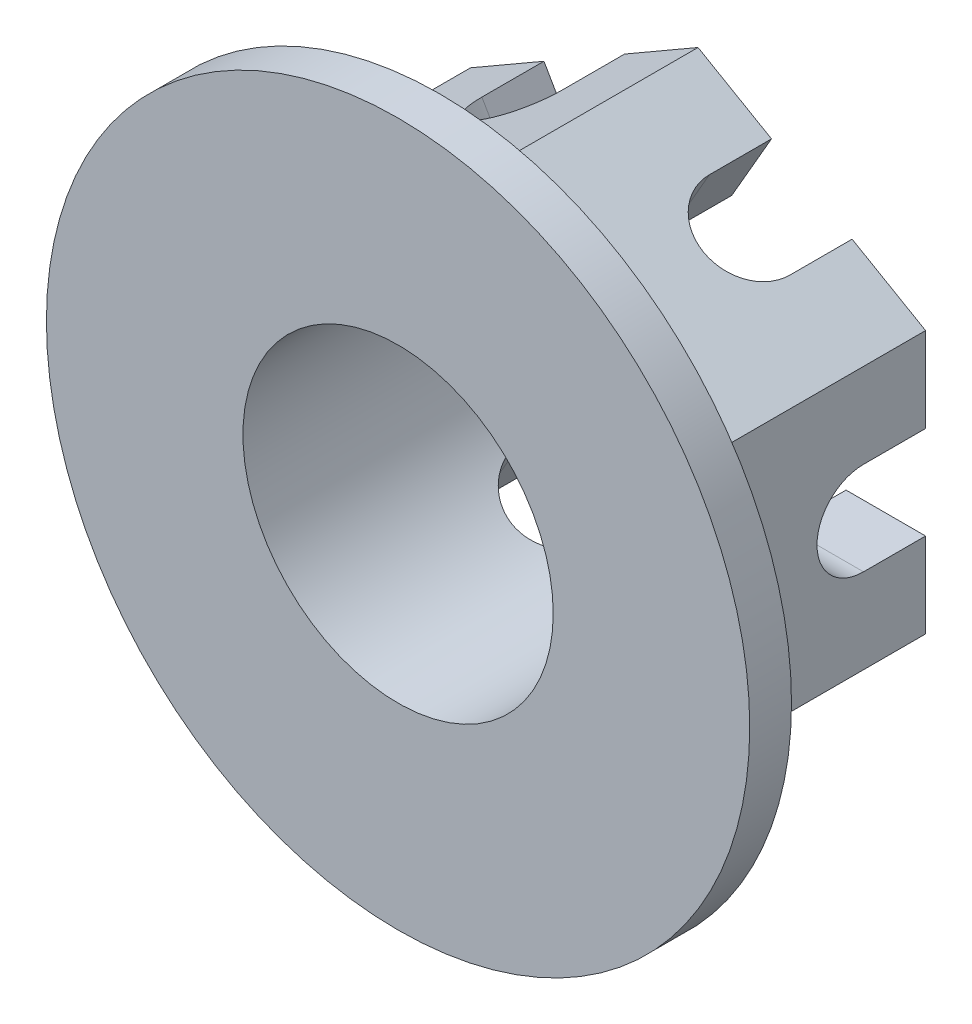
ISO-10303-21;
HEADER;
FILE_DESCRIPTION(('STEP AP214'),'2;1');
FILE_NAME('part.step','',(''),(''),'','','');
FILE_SCHEMA(('AUTOMOTIVE_DESIGN { 1 0 10303 214 1 1 1 1 }'));
ENDSEC;
DATA;
#1=APPLICATION_CONTEXT('core data for automotive mechanical design processes');
#2=APPLICATION_PROTOCOL_DEFINITION('international standard','automotive_design',2000,#1);
#3=PRODUCT_CONTEXT('',#1,'mechanical');
#4=PRODUCT('Part','Part','',(#3));
#5=PRODUCT_RELATED_PRODUCT_CATEGORY('part','',(#4));
#6=PRODUCT_DEFINITION_FORMATION('','',#4);
#7=PRODUCT_DEFINITION_CONTEXT('part definition',#1,'design');
#8=PRODUCT_DEFINITION('design','',#6,#7);
#9=PRODUCT_DEFINITION_SHAPE('','',#8);
#10=(LENGTH_UNIT() NAMED_UNIT(*) SI_UNIT(.MILLI.,.METRE.));
#11=(NAMED_UNIT(*) PLANE_ANGLE_UNIT() SI_UNIT($,.RADIAN.));
#12=(NAMED_UNIT(*) SI_UNIT($,.STERADIAN.) SOLID_ANGLE_UNIT());
#13=UNCERTAINTY_MEASURE_WITH_UNIT(LENGTH_MEASURE(1.E-05),#10,'distance_accuracy_value','');
#14=(GEOMETRIC_REPRESENTATION_CONTEXT(3) GLOBAL_UNCERTAINTY_ASSIGNED_CONTEXT((#13)) GLOBAL_UNIT_ASSIGNED_CONTEXT((#10,
#11,#12)) REPRESENTATION_CONTEXT('',''));
#15=CARTESIAN_POINT('',(0.,0.,0.));
#16=DIRECTION('',(0.,0.,1.));
#17=DIRECTION('',(1.,0.,0.));
#18=AXIS2_PLACEMENT_3D('',#15,#16,#17);
#19=CARTESIAN_POINT('',(11.,19.0525588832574,0.));
#20=DIRECTION('',(0.,0.,1.));
#21=DIRECTION('',(1.,0.,0.));
#22=AXIS2_PLACEMENT_3D('',#19,#20,#21);
#23=PLANE('',#22);
#24=DIRECTION('',(-0.500000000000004,0.866025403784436,0.));
#25=VECTOR('',#24,1.);
#26=CARTESIAN_POINT('',(23.0514428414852,-44.4262701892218,0.));
#27=LINE('',#26,#25);
#28=CARTESIAN_POINT('',(-5.52582916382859,5.07101686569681,0.));
#29=VERTEX_POINT('',#28);
#30=CARTESIAN_POINT('',(-7.44855715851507,8.40127944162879,0.));
#31=VERTEX_POINT('',#30);
#32=EDGE_CURVE('E478',#29,#31,#27,.T.);
#33=ORIENTED_EDGE('',*,*,#32,.F.);
#34=CARTESIAN_POINT('',(0.,0.,0.));
#35=DIRECTION('',(0.,0.,1.));
#36=DIRECTION('',(1.,0.,0.));
#37=AXIS2_PLACEMENT_3D('',#34,#35,#36);
#38=CIRCLE('',#37,7.5);
#39=CARTESIAN_POINT('',(-7.15454401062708,2.25000000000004,0.));
#40=VERTEX_POINT('',#39);
#41=EDGE_CURVE('E606',#29,#40,#38,.T.);
#42=ORIENTED_EDGE('',*,*,#41,.T.);
#43=DIRECTION('',(1.,0.,0.));
#44=VECTOR('',#43,1.);
#45=CARTESIAN_POINT('',(-50.,2.25000000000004,0.));
#46=LINE('',#45,#44);
#47=CARTESIAN_POINT('',(-11.,2.25000000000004,0.));
#48=VERTEX_POINT('',#47);
#49=EDGE_CURVE('E253',#48,#40,#46,.T.);
#50=ORIENTED_EDGE('',*,*,#49,.F.);
#51=DIRECTION('',(0.,-1.,0.));
#52=VECTOR('',#51,1.);
#53=CARTESIAN_POINT('',(-11.,-6.35085296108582,0.));
#54=LINE('',#53,#52);
#55=CARTESIAN_POINT('',(-11.,6.35085296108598,0.));
#56=VERTEX_POINT('',#55);
#57=EDGE_CURVE('E302',#56,#48,#54,.T.);
#58=ORIENTED_EDGE('',*,*,#57,.F.);
#59=DIRECTION('',(-0.866025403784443,-0.499999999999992,0.));
#60=VECTOR('',#59,1.);
#61=CARTESIAN_POINT('',(-11.,6.35085296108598,0.));
#62=LINE('',#61,#60);
#63=EDGE_CURVE('E297',#31,#56,#62,.T.);
#64=ORIENTED_EDGE('',*,*,#63,.F.);
#65=EDGE_LOOP('',(#33,#42,#50,#58,#64));
#66=FACE_BOUND('',#65,.T.);
#67=ADVANCED_FACE('F24',(#66),#23,.F.);
#68=DIRECTION('',(-0.499999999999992,-0.866025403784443,0.));
#69=VECTOR('',#68,1.);
#70=CARTESIAN_POINT('',(23.0514428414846,44.4262701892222,0.));
#71=LINE('',#70,#69);
#72=CARTESIAN_POINT('',(3.55144284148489,10.6512794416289,0.));
#73=VERTEX_POINT('',#72);
#74=CARTESIAN_POINT('',(1.62871484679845,7.32101686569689,0.));
#75=VERTEX_POINT('',#74);
#76=EDGE_CURVE('E371',#73,#75,#71,.T.);
#77=ORIENTED_EDGE('',*,*,#76,.T.);
#78=CARTESIAN_POINT('',(-1.62871484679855,7.32101686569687,0.));
#79=VERTEX_POINT('',#78);
#80=EDGE_CURVE('E236',#75,#79,#38,.T.);
#81=ORIENTED_EDGE('',*,*,#80,.T.);
#82=DIRECTION('',(-0.500000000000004,0.866025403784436,0.));
#83=VECTOR('',#82,1.);
#84=CARTESIAN_POINT('',(26.9485571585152,-42.1762701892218,0.));
#85=LINE('',#84,#83);
#86=CARTESIAN_POINT('',(-3.551442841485,10.6512794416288,0.));
#87=VERTEX_POINT('',#86);
#88=EDGE_CURVE('E373',#79,#87,#85,.T.);
#89=ORIENTED_EDGE('',*,*,#88,.T.);
#90=CARTESIAN_POINT('',(1.31838984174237E-13,12.7017059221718,0.));
#91=VERTEX_POINT('',#90);
#92=EDGE_CURVE('E298',#91,#87,#62,.T.);
#93=ORIENTED_EDGE('',*,*,#92,.F.);
#94=DIRECTION('',(-0.866025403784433,0.50000000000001,0.));
#95=VECTOR('',#94,1.);
#96=CARTESIAN_POINT('',(1.31838984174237E-13,12.7017059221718,0.));
#97=LINE('',#96,#95);
#98=EDGE_CURVE('E293',#73,#91,#97,.T.);
#99=ORIENTED_EDGE('',*,*,#98,.F.);
#100=EDGE_LOOP('',(#77,#81,#89,#93,#99));
#101=FACE_BOUND('',#100,.T.);
#102=ADVANCED_FACE('F369',(#101),#23,.F.);
#103=CARTESIAN_POINT('',(7.44855715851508,-8.40127944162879,0.));
#104=VERTEX_POINT('',#103);
#105=CARTESIAN_POINT('',(5.52582916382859,-5.0710168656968,0.));
#106=VERTEX_POINT('',#105);
#107=EDGE_CURVE('E480',#104,#106,#85,.T.);
#108=ORIENTED_EDGE('',*,*,#107,.T.);
#109=CARTESIAN_POINT('',(7.15454401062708,-2.25000000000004,0.));
#110=VERTEX_POINT('',#109);
#111=EDGE_CURVE('E238',#106,#110,#38,.T.);
#112=ORIENTED_EDGE('',*,*,#111,.T.);
#113=DIRECTION('',(1.,0.,0.));
#114=VECTOR('',#113,1.);
#115=CARTESIAN_POINT('',(-50.,-2.25000000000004,0.));
#116=LINE('',#115,#114);
#117=CARTESIAN_POINT('',(11.,-2.25000000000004,0.));
#118=VERTEX_POINT('',#117);
#119=EDGE_CURVE('E51',#110,#118,#116,.T.);
#120=ORIENTED_EDGE('',*,*,#119,.T.);
#121=DIRECTION('',(0.,1.,0.));
#122=VECTOR('',#121,1.);
#123=CARTESIAN_POINT('',(11.,6.3508529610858,0.));
#124=LINE('',#123,#122);
#125=CARTESIAN_POINT('',(11.,-6.3508529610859,0.));
#126=VERTEX_POINT('',#125);
#127=EDGE_CURVE('E290',#126,#118,#124,.T.);
#128=ORIENTED_EDGE('',*,*,#127,.F.);
#129=DIRECTION('',(0.86602540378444,0.499999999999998,0.));
#130=VECTOR('',#129,1.);
#131=CARTESIAN_POINT('',(11.,-6.3508529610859,0.));
#132=LINE('',#131,#130);
#133=EDGE_CURVE('E309',#104,#126,#132,.T.);
#134=ORIENTED_EDGE('',*,*,#133,.F.);
#135=EDGE_LOOP('',(#108,#112,#120,#128,#134));
#136=FACE_BOUND('',#135,.T.);
#137=ADVANCED_FACE('F417',(#136),#23,.F.);
#138=DIRECTION('',(-0.499999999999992,-0.866025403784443,0.));
#139=VECTOR('',#138,1.);
#140=CARTESIAN_POINT('',(26.9485571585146,42.1762701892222,0.));
#141=LINE('',#140,#139);
#142=CARTESIAN_POINT('',(-1.62871484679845,-7.32101686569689,0.));
#143=VERTEX_POINT('',#142);
#144=CARTESIAN_POINT('',(-3.5514428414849,-10.6512794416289,0.));
#145=VERTEX_POINT('',#144);
#146=EDGE_CURVE('E453',#143,#145,#141,.T.);
#147=ORIENTED_EDGE('',*,*,#146,.F.);
#148=CARTESIAN_POINT('',(1.62871484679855,-7.32101686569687,0.));
#149=VERTEX_POINT('',#148);
#150=EDGE_CURVE('E455',#143,#149,#38,.T.);
#151=ORIENTED_EDGE('',*,*,#150,.T.);
#152=CARTESIAN_POINT('',(3.55144284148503,-10.6512794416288,0.));
#153=VERTEX_POINT('',#152);
#154=EDGE_CURVE('E477',#153,#149,#27,.T.);
#155=ORIENTED_EDGE('',*,*,#154,.F.);
#156=CARTESIAN_POINT('',(0.,-12.7017059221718,0.));
#157=VERTEX_POINT('',#156);
#158=EDGE_CURVE('E310',#157,#153,#132,.T.);
#159=ORIENTED_EDGE('',*,*,#158,.F.);
#160=DIRECTION('',(0.866025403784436,-0.500000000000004,0.));
#161=VECTOR('',#160,1.);
#162=CARTESIAN_POINT('',(0.,-12.7017059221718,0.));
#163=LINE('',#162,#161);
#164=EDGE_CURVE('E305',#145,#157,#163,.T.);
#165=ORIENTED_EDGE('',*,*,#164,.F.);
#166=EDGE_LOOP('',(#147,#151,#155,#159,#165));
#167=FACE_BOUND('',#166,.T.);
#168=ADVANCED_FACE('F431',(#167),#23,.F.);
#169=CARTESIAN_POINT('',(-50.,0.,3.));
#170=DIRECTION('',(1.,0.,0.));
#171=DIRECTION('',(0.,0.,-1.));
#172=AXIS2_PLACEMENT_3D('',#169,#170,#171);
#173=CYLINDRICAL_SURFACE('',#172,2.25);
#174=DIRECTION('',(1.,0.,0.));
#175=VECTOR('',#174,1.);
#176=CARTESIAN_POINT('',(-50.,2.25,3.));
#177=LINE('',#176,#175);
#178=CARTESIAN_POINT('',(-11.,2.25,3.));
#179=VERTEX_POINT('',#178);
#180=CARTESIAN_POINT('',(-7.15454401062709,2.25,3.));
#181=VERTEX_POINT('',#180);
#182=EDGE_CURVE('E260',#179,#181,#177,.T.);
#183=ORIENTED_EDGE('',*,*,#182,.T.);
#184=CARTESIAN_POINT('',(-7.15454401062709,2.25,3.));
#185=CARTESIAN_POINT('',(-7.15453540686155,2.25000770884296,3.06175164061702));
#186=CARTESIAN_POINT('',(-7.15534329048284,2.24745797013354,3.12349834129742));
#187=CARTESIAN_POINT('',(-7.15852809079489,2.2373035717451,3.24652046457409));
#188=CARTESIAN_POINT('',(-7.16090465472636,2.22970004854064,3.30779598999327));
#189=CARTESIAN_POINT('',(-7.16715501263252,2.20952355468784,3.42928868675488));
#190=CARTESIAN_POINT('',(-7.17102500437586,2.19696320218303,3.48950814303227));
#191=CARTESIAN_POINT('',(-7.18013719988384,2.16699639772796,3.60860688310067));
#192=CARTESIAN_POINT('',(-7.18537943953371,2.1495898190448,3.66748613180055));
#193=CARTESIAN_POINT('',(-7.20293728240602,2.09031438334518,3.84146204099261));
#194=CARTESIAN_POINT('',(-7.21709255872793,2.04136389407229,3.95405132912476));
#195=CARTESIAN_POINT('',(-7.24869910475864,1.92611282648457,4.16941953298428));
#196=CARTESIAN_POINT('',(-7.26615190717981,1.8598041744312,4.27219385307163));
#197=CARTESIAN_POINT('',(-7.30300237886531,1.70947409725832,4.46829224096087));
#198=CARTESIAN_POINT('',(-7.32244129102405,1.62500186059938,4.56126365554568));
#199=CARTESIAN_POINT('',(-7.36072221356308,1.44170802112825,4.73195521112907));
#200=CARTESIAN_POINT('',(-7.37956412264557,1.34288399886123,4.80967277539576));
#201=CARTESIAN_POINT('',(-7.41499858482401,1.13116498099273,4.94919514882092));
#202=CARTESIAN_POINT('',(-7.43153656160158,1.01802125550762,5.01063763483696));
#203=CARTESIAN_POINT('',(-7.46001705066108,0.782431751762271,5.1134827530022));
#204=CARTESIAN_POINT('',(-7.47196074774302,0.659988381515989,5.15489055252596));
#205=CARTESIAN_POINT('',(-7.48961459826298,0.412987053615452,5.21531966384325));
#206=CARTESIAN_POINT('',(-7.49549323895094,0.288589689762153,5.23494727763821));
#207=CARTESIAN_POINT('',(-7.5009480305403,0.0381353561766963,5.25317602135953));
#208=CARTESIAN_POINT('',(-7.50052537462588,-0.0879212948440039,5.25178113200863));
#209=CARTESIAN_POINT('',(-7.49354403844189,-0.333857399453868,5.22841063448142));
#210=CARTESIAN_POINT('',(-7.48718123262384,-0.453805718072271,5.20709198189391));
#211=CARTESIAN_POINT('',(-7.46927270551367,-0.688335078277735,5.14555254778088));
#212=CARTESIAN_POINT('',(-7.45772671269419,-0.802915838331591,5.10533077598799));
#213=CARTESIAN_POINT('',(-7.43047822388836,-1.02502172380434,5.00668166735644));
#214=CARTESIAN_POINT('',(-7.41472883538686,-1.13244900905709,4.94804753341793));
#215=CARTESIAN_POINT('',(-7.38074436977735,-1.33614829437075,4.8144021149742));
#216=CARTESIAN_POINT('',(-7.36250873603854,-1.43241778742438,4.73938716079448));
#217=CARTESIAN_POINT('',(-7.32467510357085,-1.61498175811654,4.57171201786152));
#218=CARTESIAN_POINT('',(-7.30505168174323,-1.70075027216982,4.47848420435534));
#219=CARTESIAN_POINT('',(-7.26726322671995,-1.855601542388,4.27875386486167));
#220=CARTESIAN_POINT('',(-7.2490986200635,-1.92467943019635,4.17224747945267));
#221=CARTESIAN_POINT('',(-7.21615843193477,-2.04474610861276,3.9475786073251));
#222=CARTESIAN_POINT('',(-7.20141894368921,-2.09554509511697,3.82930923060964));
#223=CARTESIAN_POINT('',(-7.17743495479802,-2.17628829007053,3.58541324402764));
#224=CARTESIAN_POINT('',(-7.16818205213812,-2.20626439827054,3.45979820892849));
#225=CARTESIAN_POINT('',(-7.15971048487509,-2.23351805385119,3.2775076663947));
#226=CARTESIAN_POINT('',(-7.157777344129,-2.23969804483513,3.22216389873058));
#227=CARTESIAN_POINT('',(-7.15519392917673,-2.24793533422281,3.11122278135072));
#228=CARTESIAN_POINT('',(-7.15454176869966,-2.24999869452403,3.05562592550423));
#229=CARTESIAN_POINT('',(-7.15454401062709,-2.25,3.));
#230=B_SPLINE_CURVE_WITH_KNOTS('',3,(#184,#185,#186,#187,#188,#189,#190,#191,#192,#193,#194,
#195,#196,#197,#198,#199,#200,#201,#202,#203,#204,#205,#206,#207,#208,#209,#210,#211,#212,#213,
#214,#215,#216,#217,#218,#219,#220,#221,#222,#223,#224,#225,#226,#227,#228,#229),.UNSPECIFIED.,
.F.,.F.,(4,2,2,2,2,2,2,2,2,2,2,2,2,2,2,2,2,2,2,2,2,2,4),(0.,0.185188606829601,0.370335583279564,
0.555014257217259,0.739697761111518,1.10860010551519,1.47767434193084,1.85726339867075,
2.23691652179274,2.62442107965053,3.01182563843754,3.38815200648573,3.76440711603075,
4.12867768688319,4.49296734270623,4.86150437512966,5.23012405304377,5.61291926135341,
5.99582598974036,6.3826012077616,6.7687825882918,6.93580700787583,7.10258529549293),.UNSPECIFIED.);
#231=CARTESIAN_POINT('',(-7.15454401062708,-2.25000000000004,3.));
#232=VERTEX_POINT('',#231);
#233=EDGE_CURVE('E571',#181,#232,#230,.T.);
#234=ORIENTED_EDGE('',*,*,#233,.T.);
#235=DIRECTION('',(1.,0.,0.));
#236=VECTOR('',#235,1.);
#237=CARTESIAN_POINT('',(-50.,-2.25,3.));
#238=LINE('',#237,#236);
#239=CARTESIAN_POINT('',(-11.,-2.25,3.));
#240=VERTEX_POINT('',#239);
#241=EDGE_CURVE('E263',#240,#232,#238,.T.);
#242=ORIENTED_EDGE('',*,*,#241,.F.);
#243=CARTESIAN_POINT('',(-11.,0.,3.));
#244=DIRECTION('',(1.,0.,0.));
#245=DIRECTION('',(0.,1.,0.));
#246=AXIS2_PLACEMENT_3D('',#243,#244,#245);
#247=CIRCLE('',#246,2.25);
#248=EDGE_CURVE('E349',#179,#240,#247,.T.);
#249=ORIENTED_EDGE('',*,*,#248,.F.);
#250=EDGE_LOOP('',(#183,#234,#242,#249));
#251=FACE_BOUND('',#250,.T.);
#252=ADVANCED_FACE('F441',(#251),#173,.F.);
#253=CARTESIAN_POINT('',(-50.,2.25,3.));
#254=DIRECTION('',(0.,1.,0.));
#255=DIRECTION('',(0.,0.,1.));
#256=AXIS2_PLACEMENT_3D('',#253,#254,#255);
#257=PLANE('',#256);
#258=ORIENTED_EDGE('',*,*,#49,.T.);
#259=DIRECTION('',(0.,0.,1.));
#260=VECTOR('',#259,1.);
#261=CARTESIAN_POINT('',(-7.15454401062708,2.25000000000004,0.));
#262=LINE('',#261,#260);
#263=EDGE_CURVE('E247',#40,#181,#262,.T.);
#264=ORIENTED_EDGE('',*,*,#263,.T.);
#265=ORIENTED_EDGE('',*,*,#182,.F.);
#266=DIRECTION('',(0.,0.,1.));
#267=VECTOR('',#266,1.);
#268=CARTESIAN_POINT('',(-11.,2.2499999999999,10.0000000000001));
#269=LINE('',#268,#267);
#270=EDGE_CURVE('E273',#48,#179,#269,.T.);
#271=ORIENTED_EDGE('',*,*,#270,.F.);
#272=EDGE_LOOP('',(#258,#264,#265,#271));
#273=FACE_BOUND('',#272,.T.);
#274=ADVANCED_FACE('F436',(#273),#257,.F.);
#275=CARTESIAN_POINT('',(-50.,-2.25,3.));
#276=DIRECTION('',(0.,-1.,0.));
#277=DIRECTION('',(0.,0.,-1.));
#278=AXIS2_PLACEMENT_3D('',#275,#276,#277);
#279=PLANE('',#278);
#280=ORIENTED_EDGE('',*,*,#119,.F.);
#281=DIRECTION('',(0.,0.,1.));
#282=VECTOR('',#281,1.);
#283=CARTESIAN_POINT('',(7.15454401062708,-2.25000000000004,0.));
#284=LINE('',#283,#282);
#285=CARTESIAN_POINT('',(7.15454401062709,-2.25,3.));
#286=VERTEX_POINT('',#285);
#287=EDGE_CURVE('E513',#110,#286,#284,.T.);
#288=ORIENTED_EDGE('',*,*,#287,.T.);
#289=CARTESIAN_POINT('',(11.,-2.25,3.));
#290=VERTEX_POINT('',#289);
#291=EDGE_CURVE('E266',#286,#290,#238,.T.);
#292=ORIENTED_EDGE('',*,*,#291,.T.);
#293=DIRECTION('',(0.,0.,1.));
#294=VECTOR('',#293,1.);
#295=CARTESIAN_POINT('',(11.,-2.2499999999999,10.0000000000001));
#296=LINE('',#295,#294);
#297=EDGE_CURVE('E270',#118,#290,#296,.T.);
#298=ORIENTED_EDGE('',*,*,#297,.F.);
#299=EDGE_LOOP('',(#280,#288,#292,#298));
#300=FACE_BOUND('',#299,.T.);
#301=ADVANCED_FACE('F430',(#300),#279,.F.);
#302=CARTESIAN_POINT('',(7.15454401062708,2.25000000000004,0.));
#303=VERTEX_POINT('',#302);
#304=CARTESIAN_POINT('',(11.,2.25000000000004,0.));
#305=VERTEX_POINT('',#304);
#306=EDGE_CURVE('E243',#303,#305,#46,.T.);
#307=ORIENTED_EDGE('',*,*,#306,.F.);
#308=CARTESIAN_POINT('',(5.52582916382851,5.07101686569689,0.));
#309=VERTEX_POINT('',#308);
#310=EDGE_CURVE('E225',#303,#309,#38,.T.);
#311=ORIENTED_EDGE('',*,*,#310,.T.);
#312=CARTESIAN_POINT('',(7.44855715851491,8.40127944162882,0.));
#313=VERTEX_POINT('',#312);
#314=EDGE_CURVE('E462',#313,#309,#141,.T.);
#315=ORIENTED_EDGE('',*,*,#314,.F.);
#316=CARTESIAN_POINT('',(11.,6.3508529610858,0.));
#317=VERTEX_POINT('',#316);
#318=EDGE_CURVE('E294',#317,#313,#97,.T.);
#319=ORIENTED_EDGE('',*,*,#318,.F.);
#320=EDGE_CURVE('E252',#305,#317,#124,.T.);
#321=ORIENTED_EDGE('',*,*,#320,.F.);
#322=EDGE_LOOP('',(#307,#311,#315,#319,#321));
#323=FACE_BOUND('',#322,.T.);
#324=ADVANCED_FACE('F250',(#323),#23,.F.);
#325=CARTESIAN_POINT('',(0.,0.,10.));
#326=DIRECTION('',(0.,0.,1.));
#327=DIRECTION('',(1.,0.,0.));
#328=AXIS2_PLACEMENT_3D('',#325,#326,#327);
#329=CONICAL_SURFACE('',#328,12.7017059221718,1.0471975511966);
#330=CARTESIAN_POINT('',(0.,0.,10.));
#331=DIRECTION('',(0.,0.,1.));
#332=DIRECTION('',(1.,0.,0.));
#333=AXIS2_PLACEMENT_3D('',#330,#331,#332);
#334=CIRCLE('',#333,12.7017059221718);
#335=CARTESIAN_POINT('',(11.,6.3508529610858,10.));
#336=VERTEX_POINT('',#335);
#337=CARTESIAN_POINT('',(1.31838984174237E-13,12.7017059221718,10.));
#338=VERTEX_POINT('',#337);
#339=EDGE_CURVE('E286',#336,#338,#334,.T.);
#340=ORIENTED_EDGE('',*,*,#339,.T.);
#341=CARTESIAN_POINT('',(-11.,6.35085296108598,10.));
#342=VERTEX_POINT('',#341);
#343=EDGE_CURVE('E289',#338,#342,#334,.T.);
#344=ORIENTED_EDGE('',*,*,#343,.T.);
#345=CARTESIAN_POINT('',(-11.,-6.35085296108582,10.));
#346=VERTEX_POINT('',#345);
#347=EDGE_CURVE('E660',#342,#346,#334,.T.);
#348=ORIENTED_EDGE('',*,*,#347,.T.);
#349=CARTESIAN_POINT('',(0.,-12.7017059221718,10.));
#350=VERTEX_POINT('',#349);
#351=EDGE_CURVE('E661',#346,#350,#334,.T.);
#352=ORIENTED_EDGE('',*,*,#351,.T.);
#353=CARTESIAN_POINT('',(11.,-6.35085296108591,10.));
#354=VERTEX_POINT('',#353);
#355=EDGE_CURVE('E396',#350,#354,#334,.T.);
#356=ORIENTED_EDGE('',*,*,#355,.T.);
#357=EDGE_CURVE('E285',#354,#336,#334,.T.);
#358=ORIENTED_EDGE('',*,*,#357,.T.);
#359=EDGE_LOOP('',(#340,#344,#348,#352,#356,#358));
#360=FACE_BOUND('',#359,.T.);
#361=CARTESIAN_POINT('',(0.,0.,12.4816212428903));
#362=DIRECTION('',(0.,0.,1.));
#363=DIRECTION('',(1.,0.,0.));
#364=AXIS2_PLACEMENT_3D('',#361,#362,#363);
#365=CIRCLE('',#364,17.);
#366=CARTESIAN_POINT('',(17.,0.,12.4816212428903));
#367=VERTEX_POINT('',#366);
#368=EDGE_CURVE('E282',#367,#367,#365,.T.);
#369=ORIENTED_EDGE('',*,*,#368,.F.);
#370=EDGE_LOOP('',(#369));
#371=FACE_BOUND('',#370,.T.);
#372=ADVANCED_FACE('F391',(#360,#371),#329,.T.);
#373=CARTESIAN_POINT('',(11.,6.3508529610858,10.));
#374=DIRECTION('',(-1.,0.,0.));
#375=DIRECTION('',(0.,-1.,0.));
#376=AXIS2_PLACEMENT_3D('',#373,#374,#375);
#377=PLANE('',#376);
#378=CARTESIAN_POINT('',(11.,0.,3.));
#379=DIRECTION('',(-1.,0.,0.));
#380=DIRECTION('',(0.,-1.,0.));
#381=AXIS2_PLACEMENT_3D('',#378,#379,#380);
#382=CIRCLE('',#381,2.25);
#383=CARTESIAN_POINT('',(11.,2.25,3.));
#384=VERTEX_POINT('',#383);
#385=EDGE_CURVE('E278',#290,#384,#382,.T.);
#386=ORIENTED_EDGE('',*,*,#385,.T.);
#387=DIRECTION('',(0.,0.,-1.));
#388=VECTOR('',#387,1.);
#389=CARTESIAN_POINT('',(11.,2.2499999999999,9.99999999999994));
#390=LINE('',#389,#388);
#391=EDGE_CURVE('E276',#384,#305,#390,.T.);
#392=ORIENTED_EDGE('',*,*,#391,.T.);
#393=ORIENTED_EDGE('',*,*,#320,.T.);
#394=DIRECTION('',(0.,0.,-1.));
#395=VECTOR('',#394,1.);
#396=CARTESIAN_POINT('',(11.,6.3508529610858,10.));
#397=LINE('',#396,#395);
#398=EDGE_CURVE('E346',#336,#317,#397,.T.);
#399=ORIENTED_EDGE('',*,*,#398,.F.);
#400=DIRECTION('',(0.,1.,0.));
#401=VECTOR('',#400,1.);
#402=CARTESIAN_POINT('',(11.,6.3508529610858,10.));
#403=LINE('',#402,#401);
#404=EDGE_CURVE('E313',#354,#336,#403,.T.);
#405=ORIENTED_EDGE('',*,*,#404,.F.);
#406=DIRECTION('',(0.,0.,-1.));
#407=VECTOR('',#406,1.);
#408=CARTESIAN_POINT('',(11.,-6.3508529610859,10.));
#409=LINE('',#408,#407);
#410=EDGE_CURVE('E331',#354,#126,#409,.T.);
#411=ORIENTED_EDGE('',*,*,#410,.T.);
#412=ORIENTED_EDGE('',*,*,#127,.T.);
#413=ORIENTED_EDGE('',*,*,#297,.T.);
#414=EDGE_LOOP('',(#386,#392,#393,#399,#405,#411,#412,#413));
#415=FACE_BOUND('',#414,.T.);
#416=ADVANCED_FACE('F26',(#415),#377,.F.);
#417=CARTESIAN_POINT('',(1.31838984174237E-13,12.7017059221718,10.));
#418=DIRECTION('',(-0.50000000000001,-0.866025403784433,0.));
#419=DIRECTION('',(0.866025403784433,-0.50000000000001,0.));
#420=AXIS2_PLACEMENT_3D('',#417,#418,#419);
#421=PLANE('',#420);
#422=CARTESIAN_POINT('',(5.49999999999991,9.52627944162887,3.));
#423=DIRECTION('',(-0.50000000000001,-0.866025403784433,0.));
#424=DIRECTION('',(0.866025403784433,-0.50000000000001,0.));
#425=AXIS2_PLACEMENT_3D('',#422,#423,#424);
#426=CIRCLE('',#425,2.25);
#427=CARTESIAN_POINT('',(7.44855715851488,8.40127944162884,3.));
#428=VERTEX_POINT('',#427);
#429=CARTESIAN_POINT('',(3.55144284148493,10.6512794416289,3.));
#430=VERTEX_POINT('',#429);
#431=EDGE_CURVE('E362',#428,#430,#426,.T.);
#432=ORIENTED_EDGE('',*,*,#431,.T.);
#433=DIRECTION('',(0.,0.,-1.));
#434=VECTOR('',#433,1.);
#435=CARTESIAN_POINT('',(3.55144284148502,10.6512794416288,9.99999999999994));
#436=LINE('',#435,#434);
#437=EDGE_CURVE('E37',#430,#73,#436,.T.);
#438=ORIENTED_EDGE('',*,*,#437,.T.);
#439=ORIENTED_EDGE('',*,*,#98,.T.);
#440=DIRECTION('',(0.,0.,-1.));
#441=VECTOR('',#440,1.);
#442=CARTESIAN_POINT('',(1.31838984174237E-13,12.7017059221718,10.));
#443=LINE('',#442,#441);
#444=EDGE_CURVE('E343',#338,#91,#443,.T.);
#445=ORIENTED_EDGE('',*,*,#444,.F.);
#446=DIRECTION('',(-0.866025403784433,0.50000000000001,0.));
#447=VECTOR('',#446,1.);
#448=CARTESIAN_POINT('',(1.31838984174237E-13,12.7017059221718,10.));
#449=LINE('',#448,#447);
#450=EDGE_CURVE('E316',#336,#338,#449,.T.);
#451=ORIENTED_EDGE('',*,*,#450,.F.);
#452=ORIENTED_EDGE('',*,*,#398,.T.);
#453=ORIENTED_EDGE('',*,*,#318,.T.);
#454=DIRECTION('',(0.,0.,1.));
#455=VECTOR('',#454,1.);
#456=CARTESIAN_POINT('',(7.4485571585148,8.4012794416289,10.0000000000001));
#457=LINE('',#456,#455);
#458=EDGE_CURVE('E500',#313,#428,#457,.T.);
#459=ORIENTED_EDGE('',*,*,#458,.T.);
#460=EDGE_LOOP('',(#432,#438,#439,#445,#451,#452,#453,#459));
#461=FACE_BOUND('',#460,.T.);
#462=ADVANCED_FACE('F360',(#461),#421,.F.);
#463=CARTESIAN_POINT('',(-11.,6.35085296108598,10.));
#464=DIRECTION('',(0.499999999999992,-0.866025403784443,0.));
#465=DIRECTION('',(0.866025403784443,0.499999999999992,0.));
#466=AXIS2_PLACEMENT_3D('',#463,#464,#465);
#467=PLANE('',#466);
#468=CARTESIAN_POINT('',(-5.50000000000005,9.52627944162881,3.));
#469=DIRECTION('',(0.499999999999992,-0.866025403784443,0.));
#470=DIRECTION('',(0.866025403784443,0.499999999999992,0.));
#471=AXIS2_PLACEMENT_3D('',#468,#469,#470);
#472=CIRCLE('',#471,2.25);
#473=CARTESIAN_POINT('',(-3.55144284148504,10.6512794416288,3.));
#474=VERTEX_POINT('',#473);
#475=CARTESIAN_POINT('',(-7.44855715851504,8.40127944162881,3.));
#476=VERTEX_POINT('',#475);
#477=EDGE_CURVE('E505',#474,#476,#472,.T.);
#478=ORIENTED_EDGE('',*,*,#477,.T.);
#479=DIRECTION('',(0.,0.,-1.));
#480=VECTOR('',#479,1.);
#481=CARTESIAN_POINT('',(-7.44855715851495,8.40127944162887,9.99999999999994));
#482=LINE('',#481,#480);
#483=EDGE_CURVE('E502',#476,#31,#482,.T.);
#484=ORIENTED_EDGE('',*,*,#483,.T.);
#485=ORIENTED_EDGE('',*,*,#63,.T.);
#486=DIRECTION('',(0.,0.,-1.));
#487=VECTOR('',#486,1.);
#488=CARTESIAN_POINT('',(-11.,6.35085296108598,10.));
#489=LINE('',#488,#487);
#490=EDGE_CURVE('E340',#342,#56,#489,.T.);
#491=ORIENTED_EDGE('',*,*,#490,.F.);
#492=DIRECTION('',(-0.866025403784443,-0.499999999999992,0.));
#493=VECTOR('',#492,1.);
#494=CARTESIAN_POINT('',(-11.,6.35085296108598,10.));
#495=LINE('',#494,#493);
#496=EDGE_CURVE('E319',#338,#342,#495,.T.);
#497=ORIENTED_EDGE('',*,*,#496,.F.);
#498=ORIENTED_EDGE('',*,*,#444,.T.);
#499=ORIENTED_EDGE('',*,*,#92,.T.);
#500=DIRECTION('',(0.,0.,1.));
#501=VECTOR('',#500,1.);
#502=CARTESIAN_POINT('',(-3.55144284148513,10.6512794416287,10.0000000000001));
#503=LINE('',#502,#501);
#504=EDGE_CURVE('E354',#87,#474,#503,.T.);
#505=ORIENTED_EDGE('',*,*,#504,.T.);
#506=EDGE_LOOP('',(#478,#484,#485,#491,#497,#498,#499,#505));
#507=FACE_BOUND('',#506,.T.);
#508=ADVANCED_FACE('F377',(#507),#467,.F.);
#509=CARTESIAN_POINT('',(-11.,-6.35085296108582,10.));
#510=DIRECTION('',(1.,0.,0.));
#511=DIRECTION('',(0.,1.,0.));
#512=AXIS2_PLACEMENT_3D('',#509,#510,#511);
#513=PLANE('',#512);
#514=ORIENTED_EDGE('',*,*,#57,.T.);
#515=ORIENTED_EDGE('',*,*,#270,.T.);
#516=ORIENTED_EDGE('',*,*,#248,.T.);
#517=DIRECTION('',(0.,0.,-1.));
#518=VECTOR('',#517,1.);
#519=CARTESIAN_POINT('',(-11.,-2.2499999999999,9.99999999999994));
#520=LINE('',#519,#518);
#521=CARTESIAN_POINT('',(-11.,-2.25000000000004,0.));
#522=VERTEX_POINT('',#521);
#523=EDGE_CURVE('E267',#240,#522,#520,.T.);
#524=ORIENTED_EDGE('',*,*,#523,.T.);
#525=CARTESIAN_POINT('',(-11.,-6.35085296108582,0.));
#526=VERTEX_POINT('',#525);
#527=EDGE_CURVE('E301',#522,#526,#54,.T.);
#528=ORIENTED_EDGE('',*,*,#527,.T.);
#529=DIRECTION('',(0.,0.,-1.));
#530=VECTOR('',#529,1.);
#531=CARTESIAN_POINT('',(-11.,-6.35085296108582,10.));
#532=LINE('',#531,#530);
#533=EDGE_CURVE('E337',#346,#526,#532,.T.);
#534=ORIENTED_EDGE('',*,*,#533,.F.);
#535=DIRECTION('',(0.,-1.,0.));
#536=VECTOR('',#535,1.);
#537=CARTESIAN_POINT('',(-11.,-6.35085296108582,10.));
#538=LINE('',#537,#536);
#539=EDGE_CURVE('E322',#342,#346,#538,.T.);
#540=ORIENTED_EDGE('',*,*,#539,.F.);
#541=ORIENTED_EDGE('',*,*,#490,.T.);
#542=EDGE_LOOP('',(#514,#515,#516,#524,#528,#534,#540,#541));
#543=FACE_BOUND('',#542,.T.);
#544=ADVANCED_FACE('F651',(#543),#513,.F.);
#545=CARTESIAN_POINT('',(0.,-12.7017059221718,10.));
#546=DIRECTION('',(0.500000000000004,0.866025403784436,0.));
#547=DIRECTION('',(-0.866025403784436,0.500000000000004,0.));
#548=AXIS2_PLACEMENT_3D('',#545,#546,#547);
#549=PLANE('',#548);
#550=CARTESIAN_POINT('',(-5.49999999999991,-9.52627944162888,3.));
#551=DIRECTION('',(0.500000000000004,0.866025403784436,0.));
#552=DIRECTION('',(-0.866025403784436,0.500000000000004,0.));
#553=AXIS2_PLACEMENT_3D('',#550,#551,#552);
#554=CIRCLE('',#553,2.25);
#555=CARTESIAN_POINT('',(-7.4485571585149,-8.40127944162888,3.));
#556=VERTEX_POINT('',#555);
#557=CARTESIAN_POINT('',(-3.55144284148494,-10.6512794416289,3.));
#558=VERTEX_POINT('',#557);
#559=EDGE_CURVE('E490',#556,#558,#554,.T.);
#560=ORIENTED_EDGE('',*,*,#559,.T.);
#561=DIRECTION('',(0.,0.,-1.));
#562=VECTOR('',#561,1.);
#563=CARTESIAN_POINT('',(-3.55144284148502,-10.6512794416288,9.99999999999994));
#564=LINE('',#563,#562);
#565=EDGE_CURVE('E507',#558,#145,#564,.T.);
#566=ORIENTED_EDGE('',*,*,#565,.T.);
#567=ORIENTED_EDGE('',*,*,#164,.T.);
#568=DIRECTION('',(0.,0.,-1.));
#569=VECTOR('',#568,1.);
#570=CARTESIAN_POINT('',(0.,-12.7017059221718,10.));
#571=LINE('',#570,#569);
#572=EDGE_CURVE('E334',#350,#157,#571,.T.);
#573=ORIENTED_EDGE('',*,*,#572,.F.);
#574=DIRECTION('',(0.866025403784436,-0.500000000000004,0.));
#575=VECTOR('',#574,1.);
#576=CARTESIAN_POINT('',(0.,-12.7017059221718,10.));
#577=LINE('',#576,#575);
#578=EDGE_CURVE('E325',#346,#350,#577,.T.);
#579=ORIENTED_EDGE('',*,*,#578,.F.);
#580=ORIENTED_EDGE('',*,*,#533,.T.);
#581=CARTESIAN_POINT('',(-7.44855715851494,-8.40127944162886,0.));
#582=VERTEX_POINT('',#581);
#583=EDGE_CURVE('E306',#526,#582,#163,.T.);
#584=ORIENTED_EDGE('',*,*,#583,.T.);
#585=DIRECTION('',(0.,0.,1.));
#586=VECTOR('',#585,1.);
#587=CARTESIAN_POINT('',(-7.4485571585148,-8.40127944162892,10.0000000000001));
#588=LINE('',#587,#586);
#589=EDGE_CURVE('E487',#582,#556,#588,.T.);
#590=ORIENTED_EDGE('',*,*,#589,.T.);
#591=EDGE_LOOP('',(#560,#566,#567,#573,#579,#580,#584,#590));
#592=FACE_BOUND('',#591,.T.);
#593=ADVANCED_FACE('F427',(#592),#549,.F.);
#594=CARTESIAN_POINT('',(11.,-6.3508529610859,10.));
#595=DIRECTION('',(-0.499999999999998,0.86602540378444,0.));
#596=DIRECTION('',(-0.86602540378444,-0.499999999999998,0.));
#597=AXIS2_PLACEMENT_3D('',#594,#595,#596);
#598=PLANE('',#597);
#599=ORIENTED_EDGE('',*,*,#158,.T.);
#600=DIRECTION('',(0.,0.,1.));
#601=VECTOR('',#600,1.);
#602=CARTESIAN_POINT('',(3.55144284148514,-10.6512794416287,10.0000000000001));
#603=LINE('',#602,#601);
#604=CARTESIAN_POINT('',(3.55144284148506,-10.6512794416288,3.));
#605=VERTEX_POINT('',#604);
#606=EDGE_CURVE('E508',#153,#605,#603,.T.);
#607=ORIENTED_EDGE('',*,*,#606,.T.);
#608=CARTESIAN_POINT('',(5.50000000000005,-9.52627944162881,3.));
#609=DIRECTION('',(-0.499999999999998,0.86602540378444,0.));
#610=DIRECTION('',(-0.86602540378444,-0.499999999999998,0.));
#611=AXIS2_PLACEMENT_3D('',#608,#609,#610);
#612=CIRCLE('',#611,2.25);
#613=CARTESIAN_POINT('',(7.44855715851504,-8.40127944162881,3.));
#614=VERTEX_POINT('',#613);
#615=EDGE_CURVE('E493',#605,#614,#612,.T.);
#616=ORIENTED_EDGE('',*,*,#615,.T.);
#617=DIRECTION('',(0.,0.,-1.));
#618=VECTOR('',#617,1.);
#619=CARTESIAN_POINT('',(7.44855715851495,-8.40127944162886,9.99999999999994));
#620=LINE('',#619,#618);
#621=EDGE_CURVE('E496',#614,#104,#620,.T.);
#622=ORIENTED_EDGE('',*,*,#621,.T.);
#623=ORIENTED_EDGE('',*,*,#133,.T.);
#624=ORIENTED_EDGE('',*,*,#410,.F.);
#625=DIRECTION('',(0.86602540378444,0.499999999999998,0.));
#626=VECTOR('',#625,1.);
#627=CARTESIAN_POINT('',(11.,-6.3508529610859,10.));
#628=LINE('',#627,#626);
#629=EDGE_CURVE('E328',#350,#354,#628,.T.);
#630=ORIENTED_EDGE('',*,*,#629,.F.);
#631=ORIENTED_EDGE('',*,*,#572,.T.);
#632=EDGE_LOOP('',(#599,#607,#616,#622,#623,#624,#630,#631));
#633=FACE_BOUND('',#632,.T.);
#634=ADVANCED_FACE('F422',(#633),#598,.F.);
#635=CARTESIAN_POINT('',(-7.15454401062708,-2.25000000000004,0.));
#636=VERTEX_POINT('',#635);
#637=EDGE_CURVE('E254',#522,#636,#116,.T.);
#638=ORIENTED_EDGE('',*,*,#637,.T.);
#639=CARTESIAN_POINT('',(-5.52582916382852,-5.07101686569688,0.));
#640=VERTEX_POINT('',#639);
#641=EDGE_CURVE('E604',#636,#640,#38,.T.);
#642=ORIENTED_EDGE('',*,*,#641,.T.);
#643=EDGE_CURVE('E465',#640,#582,#71,.T.);
#644=ORIENTED_EDGE('',*,*,#643,.T.);
#645=ORIENTED_EDGE('',*,*,#583,.F.);
#646=ORIENTED_EDGE('',*,*,#527,.F.);
#647=EDGE_LOOP('',(#638,#642,#644,#645,#646));
#648=FACE_BOUND('',#647,.T.);
#649=ADVANCED_FACE('F407',(#648),#23,.F.);
#650=CARTESIAN_POINT('',(0.,0.,10.));
#651=DIRECTION('',(0.,0.,1.));
#652=DIRECTION('',(1.,0.,0.));
#653=AXIS2_PLACEMENT_3D('',#650,#651,#652);
#654=PLANE('',#653);
#655=ORIENTED_EDGE('',*,*,#357,.F.);
#656=ORIENTED_EDGE('',*,*,#404,.T.);
#657=EDGE_LOOP('',(#655,#656));
#658=FACE_BOUND('',#657,.T.);
#659=ADVANCED_FACE('F388',(#658),#654,.F.);
#660=ORIENTED_EDGE('',*,*,#339,.F.);
#661=ORIENTED_EDGE('',*,*,#450,.T.);
#662=EDGE_LOOP('',(#660,#661));
#663=FACE_BOUND('',#662,.T.);
#664=ADVANCED_FACE('F397',(#663),#654,.F.);
#665=ORIENTED_EDGE('',*,*,#343,.F.);
#666=ORIENTED_EDGE('',*,*,#496,.T.);
#667=EDGE_LOOP('',(#665,#666));
#668=FACE_BOUND('',#667,.T.);
#669=ADVANCED_FACE('F399',(#668),#654,.F.);
#670=ORIENTED_EDGE('',*,*,#347,.F.);
#671=ORIENTED_EDGE('',*,*,#539,.T.);
#672=EDGE_LOOP('',(#670,#671));
#673=FACE_BOUND('',#672,.T.);
#674=ADVANCED_FACE('F405',(#673),#654,.F.);
#675=ORIENTED_EDGE('',*,*,#351,.F.);
#676=ORIENTED_EDGE('',*,*,#578,.T.);
#677=EDGE_LOOP('',(#675,#676));
#678=FACE_BOUND('',#677,.T.);
#679=ADVANCED_FACE('F663',(#678),#654,.F.);
#680=ORIENTED_EDGE('',*,*,#355,.F.);
#681=ORIENTED_EDGE('',*,*,#629,.T.);
#682=EDGE_LOOP('',(#680,#681));
#683=FACE_BOUND('',#682,.T.);
#684=ADVANCED_FACE('F408',(#683),#654,.F.);
#685=CARTESIAN_POINT('',(0.,0.,43.8636128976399));
#686=DIRECTION('',(0.,0.,1.));
#687=DIRECTION('',(1.,0.,0.));
#688=AXIS2_PLACEMENT_3D('',#685,#686,#687);
#689=CYLINDRICAL_SURFACE('',#688,17.);
#690=CARTESIAN_POINT('',(0.,0.,14.5));
#691=DIRECTION('',(0.,0.,1.));
#692=DIRECTION('',(1.,0.,0.));
#693=AXIS2_PLACEMENT_3D('',#690,#691,#692);
#694=CIRCLE('',#693,17.);
#695=CARTESIAN_POINT('',(17.,0.,14.5));
#696=VERTEX_POINT('',#695);
#697=EDGE_CURVE('E281',#696,#696,#694,.T.);
#698=ORIENTED_EDGE('',*,*,#697,.F.);
#699=EDGE_LOOP('',(#698));
#700=FACE_BOUND('',#699,.T.);
#701=ORIENTED_EDGE('',*,*,#368,.T.);
#702=EDGE_LOOP('',(#701));
#703=FACE_BOUND('',#702,.T.);
#704=ADVANCED_FACE('F582',(#700,#703),#689,.T.);
#705=CARTESIAN_POINT('',(0.,0.,14.5));
#706=DIRECTION('',(0.,0.,1.));
#707=DIRECTION('',(1.,0.,0.));
#708=AXIS2_PLACEMENT_3D('',#705,#706,#707);
#709=PLANE('',#708);
#710=CARTESIAN_POINT('',(0.,0.,14.5));
#711=DIRECTION('',(0.,0.,1.));
#712=DIRECTION('',(1.,0.,0.));
#713=AXIS2_PLACEMENT_3D('',#710,#711,#712);
#714=CIRCLE('',#713,7.5);
#715=CARTESIAN_POINT('',(7.5,0.,14.5));
#716=VERTEX_POINT('',#715);
#717=EDGE_CURVE('E610',#716,#716,#714,.T.);
#718=ORIENTED_EDGE('',*,*,#717,.F.);
#719=EDGE_LOOP('',(#718));
#720=FACE_BOUND('',#719,.T.);
#721=ORIENTED_EDGE('',*,*,#697,.T.);
#722=EDGE_LOOP('',(#721));
#723=FACE_BOUND('',#722,.T.);
#724=ADVANCED_FACE('F581',(#720,#723),#709,.T.);
#725=ORIENTED_EDGE('',*,*,#291,.F.);
#726=CARTESIAN_POINT('',(7.15454401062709,-2.25,3.));
#727=CARTESIAN_POINT('',(7.15453540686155,-2.25000770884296,3.06175164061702));
#728=CARTESIAN_POINT('',(7.15534329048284,-2.24745797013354,3.12349834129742));
#729=CARTESIAN_POINT('',(7.15852809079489,-2.2373035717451,3.24652046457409));
#730=CARTESIAN_POINT('',(7.16090465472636,-2.22970004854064,3.30779598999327));
#731=CARTESIAN_POINT('',(7.16715501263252,-2.20952355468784,3.42928868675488));
#732=CARTESIAN_POINT('',(7.17102500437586,-2.19696320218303,3.48950814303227));
#733=CARTESIAN_POINT('',(7.18013719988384,-2.16699639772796,3.60860688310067));
#734=CARTESIAN_POINT('',(7.18537943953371,-2.1495898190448,3.66748613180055));
#735=CARTESIAN_POINT('',(7.20293728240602,-2.09031438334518,3.84146204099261));
#736=CARTESIAN_POINT('',(7.21709255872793,-2.04136389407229,3.95405132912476));
#737=CARTESIAN_POINT('',(7.24869910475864,-1.92611282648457,4.16941953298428));
#738=CARTESIAN_POINT('',(7.2661519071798,-1.8598041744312,4.27219385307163));
#739=CARTESIAN_POINT('',(7.30300237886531,-1.70947409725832,4.46829224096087));
#740=CARTESIAN_POINT('',(7.32244129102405,-1.62500186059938,4.56126365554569));
#741=CARTESIAN_POINT('',(7.36072221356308,-1.44170802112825,4.73195521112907));
#742=CARTESIAN_POINT('',(7.37956412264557,-1.34288399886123,4.80967277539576));
#743=CARTESIAN_POINT('',(7.41499858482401,-1.13116498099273,4.94919514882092));
#744=CARTESIAN_POINT('',(7.43153656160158,-1.01802125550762,5.01063763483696));
#745=CARTESIAN_POINT('',(7.46001705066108,-0.78243175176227,5.1134827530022));
#746=CARTESIAN_POINT('',(7.47196074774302,-0.659988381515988,5.15489055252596));
#747=CARTESIAN_POINT('',(7.48961459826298,-0.412987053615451,5.21531966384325));
#748=CARTESIAN_POINT('',(7.49549323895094,-0.288589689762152,5.23494727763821));
#749=CARTESIAN_POINT('',(7.5009480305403,-0.0381353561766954,5.25317602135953));
#750=CARTESIAN_POINT('',(7.50052537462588,0.0879212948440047,5.25178113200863));
#751=CARTESIAN_POINT('',(7.49354403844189,0.333857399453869,5.22841063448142));
#752=CARTESIAN_POINT('',(7.48718123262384,0.453805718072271,5.20709198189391));
#753=CARTESIAN_POINT('',(7.46927270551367,0.688335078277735,5.14555254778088));
#754=CARTESIAN_POINT('',(7.45772671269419,0.802915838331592,5.10533077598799));
#755=CARTESIAN_POINT('',(7.43047822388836,1.02502172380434,5.00668166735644));
#756=CARTESIAN_POINT('',(7.41472883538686,1.13244900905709,4.94804753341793));
#757=CARTESIAN_POINT('',(7.38074436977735,1.33614829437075,4.8144021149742));
#758=CARTESIAN_POINT('',(7.36250873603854,1.43241778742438,4.73938716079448));
#759=CARTESIAN_POINT('',(7.32467510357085,1.61498175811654,4.57171201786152));
#760=CARTESIAN_POINT('',(7.30505168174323,1.70075027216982,4.47848420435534));
#761=CARTESIAN_POINT('',(7.26726322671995,1.855601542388,4.27875386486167));
#762=CARTESIAN_POINT('',(7.2490986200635,1.92467943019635,4.17224747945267));
#763=CARTESIAN_POINT('',(7.21615843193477,2.04474610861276,3.9475786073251));
#764=CARTESIAN_POINT('',(7.20141894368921,2.09554509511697,3.82930923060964));
#765=CARTESIAN_POINT('',(7.17743495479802,2.17628829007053,3.58541324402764));
#766=CARTESIAN_POINT('',(7.16818205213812,2.20626439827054,3.45979820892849));
#767=CARTESIAN_POINT('',(7.15971048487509,2.23351805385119,3.2775076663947));
#768=CARTESIAN_POINT('',(7.157777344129,2.23969804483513,3.22216389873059));
#769=CARTESIAN_POINT('',(7.15519392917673,2.24793533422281,3.11122278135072));
#770=CARTESIAN_POINT('',(7.15454176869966,2.24999869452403,3.05562592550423));
#771=CARTESIAN_POINT('',(7.15454401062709,2.25,3.));
#772=B_SPLINE_CURVE_WITH_KNOTS('',3,(#726,#727,#728,#729,#730,#731,#732,#733,#734,#735,#736,
#737,#738,#739,#740,#741,#742,#743,#744,#745,#746,#747,#748,#749,#750,#751,#752,#753,#754,#755,
#756,#757,#758,#759,#760,#761,#762,#763,#764,#765,#766,#767,#768,#769,#770,#771),.UNSPECIFIED.,
.F.,.F.,(4,2,2,2,2,2,2,2,2,2,2,2,2,2,2,2,2,2,2,2,2,2,4),(0.,0.1851886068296,0.370335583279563,
0.555014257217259,0.739697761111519,1.10860010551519,1.47767434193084,1.85726339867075,
2.23691652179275,2.62442107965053,3.01182563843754,3.38815200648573,3.76440711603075,
4.12867768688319,4.49296734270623,4.86150437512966,5.23012405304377,5.61291926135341,
5.99582598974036,6.3826012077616,6.7687825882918,6.93580700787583,7.10258529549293),.UNSPECIFIED.);
#773=CARTESIAN_POINT('',(7.15454401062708,2.25000000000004,3.));
#774=VERTEX_POINT('',#773);
#775=EDGE_CURVE('E246',#286,#774,#772,.T.);
#776=ORIENTED_EDGE('',*,*,#775,.T.);
#777=EDGE_CURVE('E245',#774,#384,#177,.T.);
#778=ORIENTED_EDGE('',*,*,#777,.T.);
#779=ORIENTED_EDGE('',*,*,#385,.F.);
#780=EDGE_LOOP('',(#725,#776,#778,#779));
#781=FACE_BOUND('',#780,.T.);
#782=ADVANCED_FACE('F449',(#781),#173,.F.);
#783=ORIENTED_EDGE('',*,*,#777,.F.);
#784=DIRECTION('',(0.,0.,1.));
#785=VECTOR('',#784,1.);
#786=CARTESIAN_POINT('',(7.15454401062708,2.25000000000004,0.));
#787=LINE('',#786,#785);
#788=EDGE_CURVE('E228',#774,#303,#787,.F.);
#789=ORIENTED_EDGE('',*,*,#788,.T.);
#790=ORIENTED_EDGE('',*,*,#306,.T.);
#791=ORIENTED_EDGE('',*,*,#391,.F.);
#792=EDGE_LOOP('',(#783,#789,#790,#791));
#793=FACE_BOUND('',#792,.T.);
#794=ADVANCED_FACE('F241',(#793),#257,.F.);
#795=ORIENTED_EDGE('',*,*,#241,.T.);
#796=DIRECTION('',(0.,0.,1.));
#797=VECTOR('',#796,1.);
#798=CARTESIAN_POINT('',(-7.15454401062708,-2.25000000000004,0.));
#799=LINE('',#798,#797);
#800=EDGE_CURVE('E578',#232,#636,#799,.F.);
#801=ORIENTED_EDGE('',*,*,#800,.T.);
#802=ORIENTED_EDGE('',*,*,#637,.F.);
#803=ORIENTED_EDGE('',*,*,#523,.F.);
#804=EDGE_LOOP('',(#795,#801,#802,#803));
#805=FACE_BOUND('',#804,.T.);
#806=ADVANCED_FACE('F439',(#805),#279,.F.);
#807=CARTESIAN_POINT('',(23.0514428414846,44.4262701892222,3.));
#808=DIRECTION('',(-0.866025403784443,0.499999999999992,0.));
#809=DIRECTION('',(-0.499999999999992,-0.866025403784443,0.));
#810=AXIS2_PLACEMENT_3D('',#807,#808,#809);
#811=PLANE('',#810);
#812=ORIENTED_EDGE('',*,*,#643,.F.);
#813=DIRECTION('',(0.,0.,1.));
#814=VECTOR('',#813,1.);
#815=CARTESIAN_POINT('',(-5.52582916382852,-5.07101686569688,0.));
#816=LINE('',#815,#814);
#817=CARTESIAN_POINT('',(-5.52582916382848,-5.07101686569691,3.));
#818=VERTEX_POINT('',#817);
#819=EDGE_CURVE('E594',#640,#818,#816,.T.);
#820=ORIENTED_EDGE('',*,*,#819,.T.);
#821=DIRECTION('',(-0.499999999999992,-0.866025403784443,0.));
#822=VECTOR('',#821,1.);
#823=CARTESIAN_POINT('',(23.0514428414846,44.4262701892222,3.));
#824=LINE('',#823,#822);
#825=EDGE_CURVE('E473',#818,#556,#824,.T.);
#826=ORIENTED_EDGE('',*,*,#825,.T.);
#827=ORIENTED_EDGE('',*,*,#589,.F.);
#828=EDGE_LOOP('',(#812,#820,#826,#827));
#829=FACE_BOUND('',#828,.T.);
#830=ADVANCED_FACE('F593',(#829),#811,.F.);
#831=CARTESIAN_POINT('',(24.9999999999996,43.3012701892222,3.));
#832=DIRECTION('',(-0.499999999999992,-0.866025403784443,0.));
#833=DIRECTION('',(0.866025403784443,-0.499999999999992,0.));
#834=AXIS2_PLACEMENT_3D('',#831,#832,#833);
#835=CYLINDRICAL_SURFACE('',#834,2.25);
#836=ORIENTED_EDGE('',*,*,#825,.F.);
#837=CARTESIAN_POINT('',(-5.52582916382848,-5.07101686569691,3.));
#838=CARTESIAN_POINT('',(-5.52583153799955,-5.07100556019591,3.06175164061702));
#839=CARTESIAN_POINT('',(-5.52402734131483,-5.07298007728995,3.12349834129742));
#840=CARTESIAN_POINT('',(-5.51682577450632,-5.08081539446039,3.24652046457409));
#841=CARTESIAN_POINT('',(-5.51142921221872,-5.086675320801,3.30779598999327));
#842=CARTESIAN_POINT('',(-5.49708103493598,-5.10217653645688,3.42928868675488));
#843=CARTESIAN_POINT('',(-5.48813844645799,-5.11180822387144,3.48950814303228));
#844=CARTESIAN_POINT('',(-5.46674253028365,-5.13468301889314,3.60860688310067));
#845=CARTESIAN_POINT('',(-5.454289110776,-5.14792622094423,3.66748613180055));
#846=CARTESIAN_POINT('',(-5.41173399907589,-5.19276947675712,3.84146204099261));
#847=CARTESIAN_POINT('',(-5.37641926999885,-5.22950355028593,3.95405132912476));
#848=CARTESIAN_POINT('',(-5.29241219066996,-5.31450115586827,4.16941953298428));
#849=CARTESIAN_POINT('',(-5.24371361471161,-5.36277005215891,4.27219385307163));
#850=CARTESIAN_POINT('',(-5.13194918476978,-5.46984853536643,4.46829224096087));
#851=CARTESIAN_POINT('',(-5.06851353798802,-5.52891924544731,4.56126365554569));
#852=CARTESIAN_POINT('',(-4.92891687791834,-5.65371841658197,4.73195521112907));
#853=CARTESIAN_POINT('',(-4.85275371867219,-5.71944799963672,4.80967277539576));
#854=CARTESIAN_POINT('',(-4.68711690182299,-5.85599465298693,4.94919514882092));
#855=CARTESIAN_POINT('',(-4.59740054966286,-5.92688882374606,5.01063763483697));
#856=CARTESIAN_POINT('',(-4.40761429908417,-6.06934840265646,5.1134827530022));
#857=CARTESIAN_POINT('',(-4.30754707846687,-6.14091363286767,5.15489055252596));
#858=CARTESIAN_POINT('',(-4.1024645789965,-6.27970297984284,5.21531966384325));
#859=CARTESIAN_POINT('',(-3.99767262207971,-6.34699271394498,5.23494727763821));
#860=CARTESIAN_POINT('',(-3.78350020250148,-6.47694386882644,5.25317602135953));
#861=CARTESIAN_POINT('',(-3.67412061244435,-6.53960616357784,5.25178113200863));
#862=CARTESIAN_POINT('',(-3.45764303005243,-6.65652820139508,5.22841063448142));
#863=CARTESIAN_POINT('',(-3.35058333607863,-6.7109920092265,5.20709198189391));
#864=CARTESIAN_POINT('',(-3.1385206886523,-6.81274744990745,5.14555254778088));
#865=CARTESIAN_POINT('',(-3.033517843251,-6.8600387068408,5.10533077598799));
#866=CARTESIAN_POINT('',(-2.82754425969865,-6.94749376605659,5.00668166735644));
#867=CARTESIAN_POINT('',(-2.72663480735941,-6.9875680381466,4.94804753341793));
#868=CARTESIAN_POINT('',(-2.53323381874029,-7.05998627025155,4.8144021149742));
#869=CARTESIAN_POINT('',(-2.440744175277,-7.09232849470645,4.73938716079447));
#870=CARTESIAN_POINT('',(-2.26372232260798,-7.15084559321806,4.57171201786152));
#871=CARTESIAN_POINT('',(-2.17963289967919,-7.1767354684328,4.47848420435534));
#872=CARTESIAN_POINT('',(-2.02663353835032,-7.22143534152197,4.27875386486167));
#873=CARTESIAN_POINT('',(-1.95772802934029,-7.2402432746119,4.17224747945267));
#874=CARTESIAN_POINT('',(-1.8372771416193,-7.27174957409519,3.94757860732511));
#875=CARTESIAN_POINT('',(-1.78591418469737,-7.28438429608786,3.82930923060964));
#876=CARTESIAN_POINT('',(-1.70399653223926,-7.30398514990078,3.58541324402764));
#877=CARTESIAN_POINT('',(-1.67341000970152,-7.31095995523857,3.45979820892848));
#878=CARTESIAN_POINT('',(-1.64557186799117,-7.31725019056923,3.2775076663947));
#879=CARTESIAN_POINT('',(-1.63925326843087,-7.318666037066,3.22216389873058));
#880=CARTESIAN_POINT('',(-1.63082785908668,-7.32054737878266,3.11122278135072));
#881=CARTESIAN_POINT('',(-1.62871485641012,-7.32101427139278,3.05562592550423));
#882=CARTESIAN_POINT('',(-1.62871484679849,-7.32101686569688,3.));
#883=B_SPLINE_CURVE_WITH_KNOTS('',3,(#837,#838,#839,#840,#841,#842,#843,#844,#845,#846,#847,
#848,#849,#850,#851,#852,#853,#854,#855,#856,#857,#858,#859,#860,#861,#862,#863,#864,#865,#866,
#867,#868,#869,#870,#871,#872,#873,#874,#875,#876,#877,#878,#879,#880,#881,#882),.UNSPECIFIED.,
.F.,.F.,(4,2,2,2,2,2,2,2,2,2,2,2,2,2,2,2,2,2,2,2,2,2,4),(0.,0.185188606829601,0.370335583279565,
0.555014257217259,0.73969776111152,1.10860010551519,1.47767434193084,1.85726339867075,
2.23691652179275,2.62442107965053,3.01182563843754,3.38815200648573,3.76440711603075,
4.12867768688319,4.49296734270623,4.86150437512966,5.23012405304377,5.61291926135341,
5.99582598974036,6.3826012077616,6.7687825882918,6.93580700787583,7.10258529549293),.UNSPECIFIED.);
#884=CARTESIAN_POINT('',(-1.62871484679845,-7.32101686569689,3.));
#885=VERTEX_POINT('',#884);
#886=EDGE_CURVE('E565',#818,#885,#883,.T.);
#887=ORIENTED_EDGE('',*,*,#886,.T.);
#888=DIRECTION('',(-0.499999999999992,-0.866025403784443,0.));
#889=VECTOR('',#888,1.);
#890=CARTESIAN_POINT('',(26.9485571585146,42.1762701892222,3.));
#891=LINE('',#890,#889);
#892=EDGE_CURVE('E464',#885,#558,#891,.T.);
#893=ORIENTED_EDGE('',*,*,#892,.T.);
#894=ORIENTED_EDGE('',*,*,#559,.F.);
#895=EDGE_LOOP('',(#836,#887,#893,#894));
#896=FACE_BOUND('',#895,.T.);
#897=ADVANCED_FACE('F597',(#896),#835,.F.);
#898=CARTESIAN_POINT('',(26.9485571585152,-42.1762701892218,3.));
#899=DIRECTION('',(0.866025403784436,0.500000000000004,0.));
#900=DIRECTION('',(-0.500000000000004,0.866025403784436,0.));
#901=AXIS2_PLACEMENT_3D('',#898,#899,#900);
#902=PLANE('',#901);
#903=DIRECTION('',(-0.500000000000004,0.866025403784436,0.));
#904=VECTOR('',#903,1.);
#905=CARTESIAN_POINT('',(26.9485571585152,-42.1762701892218,3.));
#906=LINE('',#905,#904);
#907=CARTESIAN_POINT('',(5.52582916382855,-5.07101686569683,3.));
#908=VERTEX_POINT('',#907);
#909=EDGE_CURVE('E483',#614,#908,#906,.T.);
#910=ORIENTED_EDGE('',*,*,#909,.T.);
#911=DIRECTION('',(0.,0.,1.));
#912=VECTOR('',#911,1.);
#913=CARTESIAN_POINT('',(5.52582916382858,-5.07101686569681,0.));
#914=LINE('',#913,#912);
#915=EDGE_CURVE('E528',#908,#106,#914,.F.);
#916=ORIENTED_EDGE('',*,*,#915,.T.);
#917=ORIENTED_EDGE('',*,*,#107,.F.);
#918=ORIENTED_EDGE('',*,*,#621,.F.);
#919=EDGE_LOOP('',(#910,#916,#917,#918));
#920=FACE_BOUND('',#919,.T.);
#921=ADVANCED_FACE('F519',(#920),#902,.F.);
#922=CARTESIAN_POINT('',(25.0000000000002,-43.3012701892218,3.));
#923=DIRECTION('',(-0.500000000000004,0.866025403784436,0.));
#924=DIRECTION('',(-0.866025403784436,-0.500000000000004,0.));
#925=AXIS2_PLACEMENT_3D('',#922,#923,#924);
#926=CYLINDRICAL_SURFACE('',#925,2.25);
#927=DIRECTION('',(-0.500000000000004,0.866025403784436,0.));
#928=VECTOR('',#927,1.);
#929=CARTESIAN_POINT('',(23.0514428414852,-44.4262701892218,3.));
#930=LINE('',#929,#928);
#931=CARTESIAN_POINT('',(1.62871484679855,-7.32101686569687,3.));
#932=VERTEX_POINT('',#931);
#933=EDGE_CURVE('E476',#605,#932,#930,.T.);
#934=ORIENTED_EDGE('',*,*,#933,.T.);
#935=CARTESIAN_POINT('',(1.62871484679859,-7.32101686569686,3.));
#936=CARTESIAN_POINT('',(1.62870386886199,-7.32101326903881,3.06175164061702));
#937=CARTESIAN_POINT('',(1.631315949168,-7.32043804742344,3.12349834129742));
#938=CARTESIAN_POINT('',(1.64170231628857,-7.31811896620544,3.24652046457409));
#939=CARTESIAN_POINT('',(1.64947544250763,-7.31637536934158,3.30779598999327));
#940=CARTESIAN_POINT('',(1.67007397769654,-7.31170009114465,3.42928868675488));
#941=CARTESIAN_POINT('',(1.68288655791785,-7.30877142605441,3.48950814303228));
#942=CARTESIAN_POINT('',(1.71339466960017,-7.30167941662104,3.60860688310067));
#943=CARTESIAN_POINT('',(1.73109032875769,-7.29751603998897,3.66748613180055));
#944=CARTESIAN_POINT('',(1.79120328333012,-7.28308386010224,3.84146204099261));
#945=CARTESIAN_POINT('',(1.84067328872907,-7.27086744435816,3.95405132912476));
#946=CARTESIAN_POINT('',(1.95628691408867,-7.24061398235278,4.16941953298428));
#947=CARTESIAN_POINT('',(2.02243829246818,-7.22257422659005,4.27219385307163));
#948=CARTESIAN_POINT('',(2.17105319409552,-7.17932263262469,4.46829224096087));
#949=CARTESIAN_POINT('',(2.25392775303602,-7.15392110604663,4.56126365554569));
#950=CARTESIAN_POINT('',(2.43180533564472,-7.09542643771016,4.73195521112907));
#951=CARTESIAN_POINT('',(2.52681040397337,-7.06233199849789,4.80967277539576));
#952=CARTESIAN_POINT('',(2.727881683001,-6.9871596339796,4.94919514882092));
#953=CARTESIAN_POINT('',(2.8341360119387,-6.94491007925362,5.01063763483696));
#954=CARTESIAN_POINT('',(3.05240275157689,-6.85178015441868,5.1134827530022));
#955=CARTESIAN_POINT('',(3.16441366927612,-6.8009020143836,5.15489055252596));
#956=CARTESIAN_POINT('',(3.38715001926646,-6.69269003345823,5.21531966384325));
#957=CARTESIAN_POINT('',(3.49782061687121,-6.63558240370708,5.23494727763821));
#958=CARTESIAN_POINT('',(3.7174478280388,-6.51507922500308,5.25317602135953));
#959=CARTESIAN_POINT('',(3.8264047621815,-6.45168486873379,5.25178113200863));
#960=CARTESIAN_POINT('',(4.03590100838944,-6.32267080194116,5.22841063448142));
#961=CARTESIAN_POINT('',(4.13659789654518,-6.25718629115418,5.20709198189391));
#962=CARTESIAN_POINT('',(4.33075201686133,-6.12441237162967,5.14555254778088));
#963=CARTESIAN_POINT('',(4.42420886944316,-6.05712286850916,5.10533077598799));
#964=CARTESIAN_POINT('',(4.60293396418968,-5.92247204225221,5.00668166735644));
#965=CARTESIAN_POINT('',(4.68809402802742,-5.85511902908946,4.94804753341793));
#966=CARTESIAN_POINT('',(4.84751055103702,-5.72383797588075,4.8144021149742));
#967=CARTESIAN_POINT('',(4.92176456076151,-5.65991070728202,4.73938716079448));
#968=CARTESIAN_POINT('',(5.06095278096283,-5.53586383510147,4.57171201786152));
#969=CARTESIAN_POINT('',(5.125418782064,-5.47598519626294,4.47848420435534));
#970=CARTESIAN_POINT('',(5.2406296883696,-5.36583379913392,4.27875386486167));
#971=CARTESIAN_POINT('',(5.29137059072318,-5.31556384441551,4.17224747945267));
#972=CARTESIAN_POINT('',(5.37888129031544,-5.22700346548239,3.94757860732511));
#973=CARTESIAN_POINT('',(5.4155047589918,-5.18883920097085,3.82930923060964));
#974=CARTESIAN_POINT('',(5.47343842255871,-5.12769685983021,3.58541324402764));
#975=CARTESIAN_POINT('',(5.49477204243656,-5.10469555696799,3.45979820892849));
#976=CARTESIAN_POINT('',(5.51413861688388,-5.083732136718,3.2775076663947));
#977=CARTESIAN_POINT('',(5.51852407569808,-5.07896799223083,3.22216389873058));
#978=CARTESIAN_POINT('',(5.52436607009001,-5.07261204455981,3.11122278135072));
#979=CARTESIAN_POINT('',(5.52582691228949,-5.07101557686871,3.05562592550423));
#980=CARTESIAN_POINT('',(5.52582916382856,-5.07101686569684,3.));
#981=B_SPLINE_CURVE_WITH_KNOTS('',3,(#935,#936,#937,#938,#939,#940,#941,#942,#943,#944,#945,
#946,#947,#948,#949,#950,#951,#952,#953,#954,#955,#956,#957,#958,#959,#960,#961,#962,#963,#964,
#965,#966,#967,#968,#969,#970,#971,#972,#973,#974,#975,#976,#977,#978,#979,#980),.UNSPECIFIED.,
.F.,.F.,(4,2,2,2,2,2,2,2,2,2,2,2,2,2,2,2,2,2,2,2,2,2,4),(0.,0.185188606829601,0.370335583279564,
0.555014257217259,0.739697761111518,1.10860010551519,1.47767434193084,1.85726339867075,
2.23691652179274,2.62442107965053,3.01182563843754,3.38815200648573,3.76440711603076,
4.12867768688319,4.49296734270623,4.86150437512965,5.23012405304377,5.61291926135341,
5.99582598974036,6.3826012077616,6.7687825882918,6.93580700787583,7.10258529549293),.UNSPECIFIED.);
#982=EDGE_CURVE('E526',#932,#908,#981,.T.);
#983=ORIENTED_EDGE('',*,*,#982,.T.);
#984=ORIENTED_EDGE('',*,*,#909,.F.);
#985=ORIENTED_EDGE('',*,*,#615,.F.);
#986=EDGE_LOOP('',(#934,#983,#984,#985));
#987=FACE_BOUND('',#986,.T.);
#988=ADVANCED_FACE('F524',(#987),#926,.F.);
#989=CARTESIAN_POINT('',(26.9485571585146,42.1762701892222,3.));
#990=DIRECTION('',(0.866025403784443,-0.499999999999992,0.));
#991=DIRECTION('',(0.499999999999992,0.866025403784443,0.));
#992=AXIS2_PLACEMENT_3D('',#989,#990,#991);
#993=PLANE('',#992);
#994=ORIENTED_EDGE('',*,*,#892,.F.);
#995=DIRECTION('',(0.,0.,1.));
#996=VECTOR('',#995,1.);
#997=CARTESIAN_POINT('',(-1.62871484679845,-7.32101686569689,0.));
#998=LINE('',#997,#996);
#999=EDGE_CURVE('E531',#885,#143,#998,.F.);
#1000=ORIENTED_EDGE('',*,*,#999,.T.);
#1001=ORIENTED_EDGE('',*,*,#146,.T.);
#1002=ORIENTED_EDGE('',*,*,#565,.F.);
#1003=EDGE_LOOP('',(#994,#1000,#1001,#1002));
#1004=FACE_BOUND('',#1003,.T.);
#1005=ADVANCED_FACE('F550',(#1004),#993,.F.);
#1006=CARTESIAN_POINT('',(23.0514428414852,-44.4262701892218,3.));
#1007=DIRECTION('',(-0.866025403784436,-0.500000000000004,0.));
#1008=DIRECTION('',(0.500000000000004,-0.866025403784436,0.));
#1009=AXIS2_PLACEMENT_3D('',#1006,#1007,#1008);
#1010=PLANE('',#1009);
#1011=ORIENTED_EDGE('',*,*,#154,.T.);
#1012=DIRECTION('',(0.,0.,1.));
#1013=VECTOR('',#1012,1.);
#1014=CARTESIAN_POINT('',(1.62871484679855,-7.32101686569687,0.));
#1015=LINE('',#1014,#1013);
#1016=EDGE_CURVE('E529',#149,#932,#1015,.T.);
#1017=ORIENTED_EDGE('',*,*,#1016,.T.);
#1018=ORIENTED_EDGE('',*,*,#933,.F.);
#1019=ORIENTED_EDGE('',*,*,#606,.F.);
#1020=EDGE_LOOP('',(#1011,#1017,#1018,#1019));
#1021=FACE_BOUND('',#1020,.T.);
#1022=ADVANCED_FACE('F635',(#1021),#1010,.F.);
#1023=CARTESIAN_POINT('',(1.62871484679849,7.32101686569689,3.));
#1024=VERTEX_POINT('',#1023);
#1025=EDGE_CURVE('E471',#430,#1024,#824,.T.);
#1026=ORIENTED_EDGE('',*,*,#1025,.T.);
#1027=DIRECTION('',(0.,0.,1.));
#1028=VECTOR('',#1027,1.);
#1029=CARTESIAN_POINT('',(1.62871484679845,7.32101686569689,0.));
#1030=LINE('',#1029,#1028);
#1031=EDGE_CURVE('E44',#1024,#75,#1030,.F.);
#1032=ORIENTED_EDGE('',*,*,#1031,.T.);
#1033=ORIENTED_EDGE('',*,*,#76,.F.);
#1034=ORIENTED_EDGE('',*,*,#437,.F.);
#1035=EDGE_LOOP('',(#1026,#1032,#1033,#1034));
#1036=FACE_BOUND('',#1035,.T.);
#1037=ADVANCED_FACE('F641',(#1036),#811,.F.);
#1038=ORIENTED_EDGE('',*,*,#88,.F.);
#1039=DIRECTION('',(0.,0.,1.));
#1040=VECTOR('',#1039,1.);
#1041=CARTESIAN_POINT('',(-1.62871484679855,7.32101686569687,0.));
#1042=LINE('',#1041,#1040);
#1043=CARTESIAN_POINT('',(-1.6287148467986,7.32101686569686,3.));
#1044=VERTEX_POINT('',#1043);
#1045=EDGE_CURVE('E533',#79,#1044,#1042,.T.);
#1046=ORIENTED_EDGE('',*,*,#1045,.T.);
#1047=EDGE_CURVE('E486',#1044,#474,#906,.T.);
#1048=ORIENTED_EDGE('',*,*,#1047,.T.);
#1049=ORIENTED_EDGE('',*,*,#504,.F.);
#1050=EDGE_LOOP('',(#1038,#1046,#1048,#1049));
#1051=FACE_BOUND('',#1050,.T.);
#1052=ADVANCED_FACE('F621',(#1051),#902,.F.);
#1053=ORIENTED_EDGE('',*,*,#1047,.F.);
#1054=CARTESIAN_POINT('',(-1.6287148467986,7.32101686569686,3.));
#1055=CARTESIAN_POINT('',(-1.62870386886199,7.32101326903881,3.06175164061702));
#1056=CARTESIAN_POINT('',(-1.631315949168,7.32043804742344,3.12349834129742));
#1057=CARTESIAN_POINT('',(-1.64170231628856,7.31811896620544,3.24652046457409));
#1058=CARTESIAN_POINT('',(-1.64947544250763,7.31637536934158,3.30779598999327));
#1059=CARTESIAN_POINT('',(-1.67007397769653,7.31170009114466,3.42928868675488));
#1060=CARTESIAN_POINT('',(-1.68288655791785,7.30877142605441,3.48950814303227));
#1061=CARTESIAN_POINT('',(-1.71339466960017,7.30167941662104,3.60860688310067));
#1062=CARTESIAN_POINT('',(-1.73109032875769,7.29751603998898,3.66748613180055));
#1063=CARTESIAN_POINT('',(-1.79120328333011,7.28308386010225,3.84146204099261));
#1064=CARTESIAN_POINT('',(-1.84067328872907,7.27086744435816,3.95405132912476));
#1065=CARTESIAN_POINT('',(-1.95628691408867,7.24061398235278,4.16941953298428));
#1066=CARTESIAN_POINT('',(-2.02243829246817,7.22257422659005,4.27219385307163));
#1067=CARTESIAN_POINT('',(-2.17105319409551,7.17932263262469,4.46829224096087));
#1068=CARTESIAN_POINT('',(-2.25392775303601,7.15392110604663,4.56126365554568));
#1069=CARTESIAN_POINT('',(-2.43180533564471,7.09542643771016,4.73195521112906));
#1070=CARTESIAN_POINT('',(-2.52681040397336,7.06233199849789,4.80967277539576));
#1071=CARTESIAN_POINT('',(-2.72788168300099,6.9871596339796,4.94919514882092));
#1072=CARTESIAN_POINT('',(-2.83413601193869,6.94491007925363,5.01063763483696));
#1073=CARTESIAN_POINT('',(-3.05240275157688,6.85178015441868,5.1134827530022));
#1074=CARTESIAN_POINT('',(-3.16441366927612,6.80090201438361,5.15489055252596));
#1075=CARTESIAN_POINT('',(-3.38715001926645,6.69269003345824,5.21531966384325));
#1076=CARTESIAN_POINT('',(-3.4978206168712,6.63558240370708,5.23494727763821));
#1077=CARTESIAN_POINT('',(-3.71744782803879,6.51507922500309,5.25317602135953));
#1078=CARTESIAN_POINT('',(-3.8264047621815,6.45168486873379,5.25178113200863));
#1079=CARTESIAN_POINT('',(-4.03590100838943,6.32267080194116,5.22841063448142));
#1080=CARTESIAN_POINT('',(-4.13659789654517,6.25718629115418,5.20709198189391));
#1081=CARTESIAN_POINT('',(-4.33075201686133,6.12441237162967,5.14555254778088));
#1082=CARTESIAN_POINT('',(-4.42420886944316,6.05712286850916,5.10533077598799));
#1083=CARTESIAN_POINT('',(-4.60293396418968,5.92247204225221,5.00668166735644));
#1084=CARTESIAN_POINT('',(-4.68809402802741,5.85511902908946,4.94804753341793));
#1085=CARTESIAN_POINT('',(-4.84751055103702,5.72383797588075,4.8144021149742));
#1086=CARTESIAN_POINT('',(-4.92176456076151,5.65991070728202,4.73938716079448));
#1087=CARTESIAN_POINT('',(-5.06095278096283,5.53586383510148,4.57171201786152));
#1088=CARTESIAN_POINT('',(-5.12541878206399,5.47598519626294,4.47848420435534));
#1089=CARTESIAN_POINT('',(-5.2406296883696,5.36583379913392,4.27875386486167));
#1090=CARTESIAN_POINT('',(-5.29137059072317,5.31556384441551,4.17224747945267));
#1091=CARTESIAN_POINT('',(-5.37888129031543,5.22700346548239,3.9475786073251));
#1092=CARTESIAN_POINT('',(-5.4155047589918,5.18883920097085,3.82930923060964));
#1093=CARTESIAN_POINT('',(-5.47343842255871,5.12769685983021,3.58541324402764));
#1094=CARTESIAN_POINT('',(-5.49477204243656,5.10469555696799,3.45979820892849));
#1095=CARTESIAN_POINT('',(-5.51413861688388,5.08373213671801,3.2775076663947));
#1096=CARTESIAN_POINT('',(-5.51852407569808,5.07896799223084,3.22216389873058));
#1097=CARTESIAN_POINT('',(-5.52436607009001,5.07261204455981,3.11122278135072));
#1098=CARTESIAN_POINT('',(-5.52582691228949,5.07101557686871,3.05562592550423));
#1099=CARTESIAN_POINT('',(-5.52582916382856,5.07101686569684,3.));
#1100=B_SPLINE_CURVE_WITH_KNOTS('',3,(#1054,#1055,#1056,#1057,#1058,#1059,#1060,#1061,#1062,
#1063,#1064,#1065,#1066,#1067,#1068,#1069,#1070,#1071,#1072,#1073,#1074,#1075,#1076,#1077,#1078,
#1079,#1080,#1081,#1082,#1083,#1084,#1085,#1086,#1087,#1088,#1089,#1090,#1091,#1092,#1093,#1094,
#1095,#1096,#1097,#1098,#1099),.UNSPECIFIED.,.F.,.F.,(4,2,2,2,2,2,2,2,2,2,2,2,2,2,2,2,2,2,2,2,2,
2,4),(0.,0.1851886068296,0.370335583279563,0.555014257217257,0.739697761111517,1.10860010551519,
1.47767434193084,1.85726339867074,2.23691652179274,2.62442107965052,3.01182563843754,
3.38815200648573,3.76440711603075,4.12867768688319,4.49296734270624,4.86150437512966,
5.23012405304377,5.61291926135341,5.99582598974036,6.38260120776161,6.7687825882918,
6.93580700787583,7.10258529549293),.UNSPECIFIED.);
#1101=CARTESIAN_POINT('',(-5.52582916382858,5.07101686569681,3.));
#1102=VERTEX_POINT('',#1101);
#1103=EDGE_CURVE('E558',#1044,#1102,#1100,.T.);
#1104=ORIENTED_EDGE('',*,*,#1103,.T.);
#1105=EDGE_CURVE('E474',#1102,#476,#930,.T.);
#1106=ORIENTED_EDGE('',*,*,#1105,.T.);
#1107=ORIENTED_EDGE('',*,*,#477,.F.);
#1108=EDGE_LOOP('',(#1053,#1104,#1106,#1107));
#1109=FACE_BOUND('',#1108,.T.);
#1110=ADVANCED_FACE('F541',(#1109),#926,.F.);
#1111=ORIENTED_EDGE('',*,*,#1105,.F.);
#1112=DIRECTION('',(0.,0.,1.));
#1113=VECTOR('',#1112,1.);
#1114=CARTESIAN_POINT('',(-5.52582916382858,5.07101686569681,0.));
#1115=LINE('',#1114,#1113);
#1116=EDGE_CURVE('E612',#1102,#29,#1115,.F.);
#1117=ORIENTED_EDGE('',*,*,#1116,.T.);
#1118=ORIENTED_EDGE('',*,*,#32,.T.);
#1119=ORIENTED_EDGE('',*,*,#483,.F.);
#1120=EDGE_LOOP('',(#1111,#1117,#1118,#1119));
#1121=FACE_BOUND('',#1120,.T.);
#1122=ADVANCED_FACE('F629',(#1121),#1010,.F.);
#1123=ORIENTED_EDGE('',*,*,#314,.T.);
#1124=DIRECTION('',(0.,0.,1.));
#1125=VECTOR('',#1124,1.);
#1126=CARTESIAN_POINT('',(5.52582916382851,5.07101686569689,0.));
#1127=LINE('',#1126,#1125);
#1128=CARTESIAN_POINT('',(5.52582916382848,5.07101686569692,3.));
#1129=VERTEX_POINT('',#1128);
#1130=EDGE_CURVE('E231',#309,#1129,#1127,.T.);
#1131=ORIENTED_EDGE('',*,*,#1130,.T.);
#1132=EDGE_CURVE('E468',#428,#1129,#891,.T.);
#1133=ORIENTED_EDGE('',*,*,#1132,.F.);
#1134=ORIENTED_EDGE('',*,*,#458,.F.);
#1135=EDGE_LOOP('',(#1123,#1131,#1133,#1134));
#1136=FACE_BOUND('',#1135,.T.);
#1137=ADVANCED_FACE('F627',(#1136),#993,.F.);
#1138=ORIENTED_EDGE('',*,*,#1132,.T.);
#1139=CARTESIAN_POINT('',(5.52582916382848,5.07101686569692,3.));
#1140=CARTESIAN_POINT('',(5.52583153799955,5.07100556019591,3.06175164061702));
#1141=CARTESIAN_POINT('',(5.52402734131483,5.07298007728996,3.12349834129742));
#1142=CARTESIAN_POINT('',(5.51682577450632,5.0808153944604,3.24652046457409));
#1143=CARTESIAN_POINT('',(5.51142921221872,5.086675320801,3.30779598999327));
#1144=CARTESIAN_POINT('',(5.49708103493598,5.10217653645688,3.42928868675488));
#1145=CARTESIAN_POINT('',(5.48813844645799,5.11180822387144,3.48950814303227));
#1146=CARTESIAN_POINT('',(5.46674253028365,5.13468301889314,3.60860688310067));
#1147=CARTESIAN_POINT('',(5.454289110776,5.14792622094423,3.66748613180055));
#1148=CARTESIAN_POINT('',(5.41173399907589,5.19276947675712,3.84146204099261));
#1149=CARTESIAN_POINT('',(5.37641926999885,5.22950355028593,3.95405132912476));
#1150=CARTESIAN_POINT('',(5.29241219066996,5.31450115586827,4.16941953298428));
#1151=CARTESIAN_POINT('',(5.24371361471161,5.36277005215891,4.27219385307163));
#1152=CARTESIAN_POINT('',(5.13194918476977,5.46984853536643,4.46829224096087));
#1153=CARTESIAN_POINT('',(5.06851353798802,5.52891924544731,4.56126365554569));
#1154=CARTESIAN_POINT('',(4.92891687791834,5.65371841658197,4.73195521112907));
#1155=CARTESIAN_POINT('',(4.85275371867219,5.71944799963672,4.80967277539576));
#1156=CARTESIAN_POINT('',(4.68711690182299,5.85599465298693,4.94919514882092));
#1157=CARTESIAN_POINT('',(4.59740054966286,5.92688882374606,5.01063763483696));
#1158=CARTESIAN_POINT('',(4.40761429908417,6.06934840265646,5.1134827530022));
#1159=CARTESIAN_POINT('',(4.30754707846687,6.14091363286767,5.15489055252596));
#1160=CARTESIAN_POINT('',(4.1024645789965,6.27970297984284,5.21531966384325));
#1161=CARTESIAN_POINT('',(3.9976726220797,6.34699271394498,5.23494727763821));
#1162=CARTESIAN_POINT('',(3.78350020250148,6.47694386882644,5.25317602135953));
#1163=CARTESIAN_POINT('',(3.67412061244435,6.53960616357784,5.25178113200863));
#1164=CARTESIAN_POINT('',(3.45764303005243,6.65652820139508,5.22841063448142));
#1165=CARTESIAN_POINT('',(3.35058333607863,6.7109920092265,5.20709198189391));
#1166=CARTESIAN_POINT('',(3.1385206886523,6.81274744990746,5.14555254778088));
#1167=CARTESIAN_POINT('',(3.03351784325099,6.8600387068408,5.10533077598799));
#1168=CARTESIAN_POINT('',(2.82754425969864,6.94749376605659,5.00668166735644));
#1169=CARTESIAN_POINT('',(2.72663480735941,6.9875680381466,4.94804753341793));
#1170=CARTESIAN_POINT('',(2.53323381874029,7.05998627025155,4.81440211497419));
#1171=CARTESIAN_POINT('',(2.44074417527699,7.09232849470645,4.73938716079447));
#1172=CARTESIAN_POINT('',(2.26372232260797,7.15084559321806,4.57171201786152));
#1173=CARTESIAN_POINT('',(2.17963289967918,7.1767354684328,4.47848420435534));
#1174=CARTESIAN_POINT('',(2.02663353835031,7.22143534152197,4.27875386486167));
#1175=CARTESIAN_POINT('',(1.95772802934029,7.24024327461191,4.17224747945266));
#1176=CARTESIAN_POINT('',(1.83727714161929,7.27174957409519,3.9475786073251));
#1177=CARTESIAN_POINT('',(1.78591418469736,7.28438429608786,3.82930923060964));
#1178=CARTESIAN_POINT('',(1.70399653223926,7.30398514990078,3.58541324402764));
#1179=CARTESIAN_POINT('',(1.67341000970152,7.31095995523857,3.45979820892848));
#1180=CARTESIAN_POINT('',(1.64557186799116,7.31725019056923,3.2775076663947));
#1181=CARTESIAN_POINT('',(1.63925326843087,7.318666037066,3.22216389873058));
#1182=CARTESIAN_POINT('',(1.63082785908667,7.32054737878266,3.11122278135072));
#1183=CARTESIAN_POINT('',(1.62871485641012,7.32101427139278,3.05562592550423));
#1184=CARTESIAN_POINT('',(1.62871484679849,7.32101686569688,3.));
#1185=B_SPLINE_CURVE_WITH_KNOTS('',3,(#1139,#1140,#1141,#1142,#1143,#1144,#1145,#1146,#1147,
#1148,#1149,#1150,#1151,#1152,#1153,#1154,#1155,#1156,#1157,#1158,#1159,#1160,#1161,#1162,#1163,
#1164,#1165,#1166,#1167,#1168,#1169,#1170,#1171,#1172,#1173,#1174,#1175,#1176,#1177,#1178,#1179,
#1180,#1181,#1182,#1183,#1184),.UNSPECIFIED.,.F.,.F.,(4,2,2,2,2,2,2,2,2,2,2,2,2,2,2,2,2,2,2,2,2,
2,4),(0.,0.185188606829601,0.370335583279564,0.555014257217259,0.739697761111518,
1.10860010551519,1.47767434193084,1.85726339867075,2.23691652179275,2.62442107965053,
3.01182563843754,3.38815200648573,3.76440711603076,4.1286776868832,4.49296734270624,
4.86150437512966,5.23012405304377,5.61291926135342,5.99582598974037,6.38260120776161,
6.76878258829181,6.93580700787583,7.10258529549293),.UNSPECIFIED.);
#1186=EDGE_CURVE('E11',#1129,#1024,#1185,.T.);
#1187=ORIENTED_EDGE('',*,*,#1186,.T.);
#1188=ORIENTED_EDGE('',*,*,#1025,.F.);
#1189=ORIENTED_EDGE('',*,*,#431,.F.);
#1190=EDGE_LOOP('',(#1138,#1187,#1188,#1189));
#1191=FACE_BOUND('',#1190,.T.);
#1192=ADVANCED_FACE('F548',(#1191),#835,.F.);
#1193=CARTESIAN_POINT('',(0.,0.,0.));
#1194=DIRECTION('',(0.,0.,1.));
#1195=DIRECTION('',(1.,0.,0.));
#1196=AXIS2_PLACEMENT_3D('',#1193,#1194,#1195);
#1197=CYLINDRICAL_SURFACE('',#1196,7.5);
#1198=ORIENTED_EDGE('',*,*,#717,.T.);
#1199=EDGE_LOOP('',(#1198));
#1200=FACE_BOUND('',#1199,.T.);
#1201=ORIENTED_EDGE('',*,*,#111,.F.);
#1202=ORIENTED_EDGE('',*,*,#915,.F.);
#1203=ORIENTED_EDGE('',*,*,#982,.F.);
#1204=ORIENTED_EDGE('',*,*,#1016,.F.);
#1205=ORIENTED_EDGE('',*,*,#150,.F.);
#1206=ORIENTED_EDGE('',*,*,#999,.F.);
#1207=ORIENTED_EDGE('',*,*,#886,.F.);
#1208=ORIENTED_EDGE('',*,*,#819,.F.);
#1209=ORIENTED_EDGE('',*,*,#641,.F.);
#1210=ORIENTED_EDGE('',*,*,#800,.F.);
#1211=ORIENTED_EDGE('',*,*,#233,.F.);
#1212=ORIENTED_EDGE('',*,*,#263,.F.);
#1213=ORIENTED_EDGE('',*,*,#41,.F.);
#1214=ORIENTED_EDGE('',*,*,#1116,.F.);
#1215=ORIENTED_EDGE('',*,*,#1103,.F.);
#1216=ORIENTED_EDGE('',*,*,#1045,.F.);
#1217=ORIENTED_EDGE('',*,*,#80,.F.);
#1218=ORIENTED_EDGE('',*,*,#1031,.F.);
#1219=ORIENTED_EDGE('',*,*,#1186,.F.);
#1220=ORIENTED_EDGE('',*,*,#1130,.F.);
#1221=ORIENTED_EDGE('',*,*,#310,.F.);
#1222=ORIENTED_EDGE('',*,*,#788,.F.);
#1223=ORIENTED_EDGE('',*,*,#775,.F.);
#1224=ORIENTED_EDGE('',*,*,#287,.F.);
#1225=EDGE_LOOP('',(#1201,#1202,#1203,#1204,#1205,#1206,#1207,#1208,#1209,#1210,#1211,#1212,
#1213,#1214,#1215,#1216,#1217,#1218,#1219,#1220,#1221,#1222,#1223,#1224));
#1226=FACE_BOUND('',#1225,.T.);
#1227=ADVANCED_FACE('F227',(#1200,#1226),#1197,.F.);
#1228=CLOSED_SHELL('',(#67,#102,#137,#168,#252,#274,#301,#324,#372,#416,#462,#508,#544,#593,
#634,#649,#659,#664,#669,#674,#679,#684,#704,#724,#782,#794,#806,#830,#897,#921,#988,#1005,
#1022,#1037,#1052,#1110,#1122,#1137,#1192,#1227));
#1229=MANIFOLD_SOLID_BREP('B2',#1228);
#1230=ADVANCED_BREP_SHAPE_REPRESENTATION('',(#18,#1229),#14);
#1231=SHAPE_DEFINITION_REPRESENTATION(#9,#1230);
ENDSEC;
END-ISO-10303-21;
